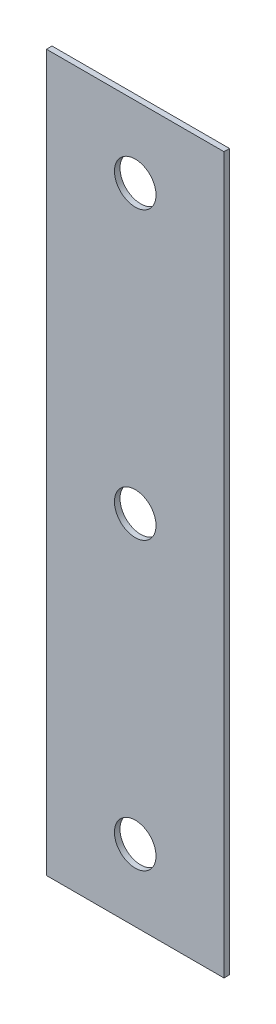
from build123d import *

# Parameters (mm, degrees)
SKETCH2_R                      = 0.85
BOSS_EXTRUDE1_DEPTH            = 64.5
CUT_EXTRUDE3_REACH             = 66.511
SKETCH7_W                      = 2.752157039
SKETCH7_H                      = 12.9
SKETCH7_W_2                    = 2.955775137
CUT_EXTRUDE3_DIRECTION_2_REACH = 66.511
SKETCH6_W                      = 16
SKETCH6_H                      = 0.5
BOSS_EXTRUDE3_DEPTH            = 64.5
SKETCH8_R                      = 1.875
CUT_EXTRUDE4_DEPTH             = 0.5


with BuildPart() as part:
    # Sketch2 → Boss-Extrude1 (new body)
    with BuildSketch(Plane(origin=(0, 0, 0), x_dir=(1, 0, 0), z_dir=(0, 1, 0))):
        with Locations(Location((0, 0, 0), (0, 0, 270))):
            Circle(SKETCH2_R)
    extrude(amount=BOSS_EXTRUDE1_DEPTH)

    # Sketch7 → Cut-Extrude3 (cut, up to next)
    with BuildSketch(Plane.XY, mode=Mode.PRIVATE) as cut_extrude3_sk1:
        with Locations((-0.044815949, 6.45)):
            Rectangle(SKETCH7_W, SKETCH7_H)
    cut_extrude3_tool1 = extrude(cut_extrude3_sk1.sketch, amount=-CUT_EXTRUDE3_REACH, mode=Mode.PRIVATE) & part.part
    # Sketch7 → Cut-Extrude3 (cut, up to next)
    with BuildSketch(Plane.XY, mode=Mode.PRIVATE) as cut_extrude3_sk2:
        with Locations((-0.044815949, 32.292118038)):
            Rectangle(SKETCH7_W_2, SKETCH7_H)
    cut_extrude3_tool2 = extrude(cut_extrude3_sk2.sketch, amount=-CUT_EXTRUDE3_REACH, mode=Mode.PRIVATE) & part.part
    # Sketch7 → Cut-Extrude3 (cut, up to next)
    with BuildSketch(Plane.XY, mode=Mode.PRIVATE) as cut_extrude3_sk3:
        with Locations((-0.044815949, 58.092118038)):
            Rectangle(SKETCH7_W_2, SKETCH7_H)
    cut_extrude3_tool3 = extrude(cut_extrude3_sk3.sketch, amount=-CUT_EXTRUDE3_REACH, mode=Mode.PRIVATE) & part.part
    add(cut_extrude3_tool1.solids().sort_by_distance((-0.044816, 6.45, 0))[0], mode=Mode.SUBTRACT)
    add(cut_extrude3_tool2.solids().sort_by_distance((-0.044816, 32.292118, 0))[0], mode=Mode.SUBTRACT)
    add(cut_extrude3_tool3.solids().sort_by_distance((-0.044816, 58.092118, 0))[0], mode=Mode.SUBTRACT)

    # Sketch7 → Cut-Extrude3 direction 2 (cut, up to next)
    with BuildSketch(Plane.XY, mode=Mode.PRIVATE) as cut_extrude3_direction_2_sk1:
        with Locations((-0.044815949, 6.45)):
            Rectangle(SKETCH7_W, SKETCH7_H)
    cut_extrude3_direction_2_tool1 = extrude(cut_extrude3_direction_2_sk1.sketch, amount=CUT_EXTRUDE3_DIRECTION_2_REACH, mode=Mode.PRIVATE) & part.part
    # Sketch7 → Cut-Extrude3 direction 2 (cut, up to next)
    with BuildSketch(Plane.XY, mode=Mode.PRIVATE) as cut_extrude3_direction_2_sk2:
        with Locations((-0.044815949, 32.292118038)):
            Rectangle(SKETCH7_W_2, SKETCH7_H)
    cut_extrude3_direction_2_tool2 = extrude(cut_extrude3_direction_2_sk2.sketch, amount=CUT_EXTRUDE3_DIRECTION_2_REACH, mode=Mode.PRIVATE) & part.part
    # Sketch7 → Cut-Extrude3 direction 2 (cut, up to next)
    with BuildSketch(Plane.XY, mode=Mode.PRIVATE) as cut_extrude3_direction_2_sk3:
        with Locations((-0.044815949, 58.092118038)):
            Rectangle(SKETCH7_W_2, SKETCH7_H)
    cut_extrude3_direction_2_tool3 = extrude(cut_extrude3_direction_2_sk3.sketch, amount=CUT_EXTRUDE3_DIRECTION_2_REACH, mode=Mode.PRIVATE) & part.part
    add(cut_extrude3_direction_2_tool1.solids().sort_by_distance((-0.044816, 6.45, 0))[0], mode=Mode.SUBTRACT)
    add(cut_extrude3_direction_2_tool2.solids().sort_by_distance((-0.044816, 32.292118, 0))[0], mode=Mode.SUBTRACT)
    add(cut_extrude3_direction_2_tool3.solids().sort_by_distance((-0.044816, 58.092118, 0))[0], mode=Mode.SUBTRACT)


with BuildPart() as cut_extrude3_piece_1:
    # of the separate pieces the step leaves, piece 1, a body of its own (cut_extrude3_pieces)
    add(part.part.solids().sort_by_distance((0, 12.9, 0.85))[0])


with BuildPart() as cut_extrude3_piece_2:
    # of the separate pieces the step leaves, piece 2, a body of its own (cut_extrude3_pieces)
    add(part.part.solids().sort_by_distance((0, 38.742118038, 0.85))[0])


with BuildPart() as body_3:
    # Sketch6 → Boss-Extrude3 (new body)
    with BuildSketch(Plane(origin=(0, 0, 0), x_dir=(-1, 0, 0), z_dir=(0, -1, 0))):
        with Locations((-8, -1.1)):
            Rectangle(SKETCH6_W, SKETCH6_H)
    extrude(amount=-BOSS_EXTRUDE3_DEPTH)

    # Sketch8 → Cut-Extrude4 (cut)
    with BuildSketch(Plane(origin=(0, 0, 0.85), x_dir=(-1, 0, 0), z_dir=(0, 0, -1))):
        with Locations((-8, 32.25)):
            Circle(SKETCH8_R)
        with Locations((-8, 6.45)):
            Circle(SKETCH8_R)
        with Locations((-8, 58.05)):
            Circle(SKETCH8_R)
    extrude(amount=-CUT_EXTRUDE4_DEPTH, mode=Mode.SUBTRACT)


solid = Compound([cut_extrude3_piece_1.part, cut_extrude3_piece_2.part, body_3.part])
